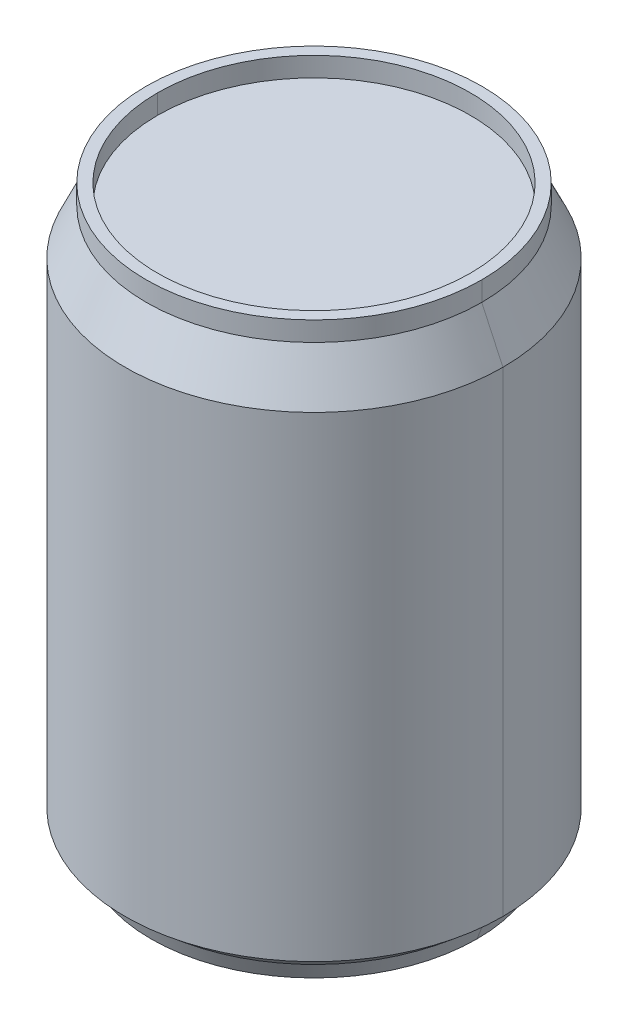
ISO-10303-21;
HEADER;
FILE_DESCRIPTION(('STEP AP214'),'2;1');
FILE_NAME('part.step','',(''),(''),'','','');
FILE_SCHEMA(('AUTOMOTIVE_DESIGN { 1 0 10303 214 1 1 1 1 }'));
ENDSEC;
DATA;
#1=APPLICATION_CONTEXT('core data for automotive mechanical design processes');
#2=APPLICATION_PROTOCOL_DEFINITION('international standard','automotive_design',2000,#1);
#3=PRODUCT_CONTEXT('',#1,'mechanical');
#4=PRODUCT('Part','Part','',(#3));
#5=PRODUCT_RELATED_PRODUCT_CATEGORY('part','',(#4));
#6=PRODUCT_DEFINITION_FORMATION('','',#4);
#7=PRODUCT_DEFINITION_CONTEXT('part definition',#1,'design');
#8=PRODUCT_DEFINITION('design','',#6,#7);
#9=PRODUCT_DEFINITION_SHAPE('','',#8);
#10=(LENGTH_UNIT() NAMED_UNIT(*) SI_UNIT(.MILLI.,.METRE.));
#11=(NAMED_UNIT(*) PLANE_ANGLE_UNIT() SI_UNIT($,.RADIAN.));
#12=(NAMED_UNIT(*) SI_UNIT($,.STERADIAN.) SOLID_ANGLE_UNIT());
#13=UNCERTAINTY_MEASURE_WITH_UNIT(LENGTH_MEASURE(1.E-05),#10,'distance_accuracy_value','');
#14=(GEOMETRIC_REPRESENTATION_CONTEXT(3) GLOBAL_UNCERTAINTY_ASSIGNED_CONTEXT((#13)) GLOBAL_UNIT_ASSIGNED_CONTEXT((#10,
#11,#12)) REPRESENTATION_CONTEXT('',''));
#15=CARTESIAN_POINT('',(0.,0.,0.));
#16=DIRECTION('',(0.,0.,1.));
#17=DIRECTION('',(1.,0.,0.));
#18=AXIS2_PLACEMENT_3D('',#15,#16,#17);
#19=CARTESIAN_POINT('',(0.,-26.0166666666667,0.));
#20=DIRECTION('',(0.,0.,1.));
#21=DIRECTION('',(-1.,0.,0.));
#22=AXIS2_PLACEMENT_3D('',#19,#20,#21);
#23=SPHERICAL_SURFACE('',#22,36.0166666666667);
#24=CARTESIAN_POINT('',(0.,-26.0166666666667,0.));
#25=DIRECTION('',(0.,0.,1.));
#26=DIRECTION('',(1.,0.,0.));
#27=AXIS2_PLACEMENT_3D('',#24,#25,#26);
#28=CIRCLE('',#27,36.0166666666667);
#29=CARTESIAN_POINT('',(22.,2.5,0.));
#30=VERTEX_POINT('',#29);
#31=CARTESIAN_POINT('',(0.,10.,0.));
#32=VERTEX_POINT('',#31);
#33=EDGE_CURVE('E253',#30,#32,#28,.T.);
#34=ORIENTED_EDGE('',*,*,#33,.F.);
#35=CARTESIAN_POINT('',(0.,2.5,0.));
#36=DIRECTION('',(0.,1.,0.));
#37=DIRECTION('',(-1.,0.,0.));
#38=AXIS2_PLACEMENT_3D('',#35,#36,#37);
#39=CIRCLE('',#38,22.);
#40=CARTESIAN_POINT('',(-22.,2.5,0.));
#41=VERTEX_POINT('',#40);
#42=EDGE_CURVE('E11',#41,#30,#39,.T.);
#43=ORIENTED_EDGE('',*,*,#42,.F.);
#44=CARTESIAN_POINT('',(0.,-26.0166666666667,0.));
#45=DIRECTION('',(0.,0.,-1.));
#46=DIRECTION('',(-1.,0.,0.));
#47=AXIS2_PLACEMENT_3D('',#44,#45,#46);
#48=CIRCLE('',#47,36.0166666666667);
#49=EDGE_CURVE('E251',#41,#32,#48,.T.);
#50=ORIENTED_EDGE('',*,*,#49,.T.);
#51=EDGE_LOOP('',(#34,#43,#50));
#52=FACE_BOUND('',#51,.T.);
#53=ADVANCED_FACE('F16',(#52),#23,.F.);
#54=CARTESIAN_POINT('',(0.,85.,0.));
#55=DIRECTION('',(0.,1.,0.));
#56=DIRECTION('',(-1.,0.,0.));
#57=AXIS2_PLACEMENT_3D('',#54,#55,#56);
#58=CYLINDRICAL_SURFACE('',#57,22.);
#59=DIRECTION('',(0.,1.,0.));
#60=VECTOR('',#59,1.);
#61=CARTESIAN_POINT('',(22.,85.,0.));
#62=LINE('',#61,#60);
#63=CARTESIAN_POINT('',(22.,0.,0.));
#64=VERTEX_POINT('',#63);
#65=EDGE_CURVE('E265',#64,#30,#62,.T.);
#66=ORIENTED_EDGE('',*,*,#65,.F.);
#67=CARTESIAN_POINT('',(0.,0.,0.));
#68=DIRECTION('',(0.,1.,0.));
#69=DIRECTION('',(-1.,0.,0.));
#70=AXIS2_PLACEMENT_3D('',#67,#68,#69);
#71=CIRCLE('',#70,22.);
#72=CARTESIAN_POINT('',(-22.,0.,0.));
#73=VERTEX_POINT('',#72);
#74=EDGE_CURVE('E27',#73,#64,#71,.T.);
#75=ORIENTED_EDGE('',*,*,#74,.F.);
#76=DIRECTION('',(0.,1.,0.));
#77=VECTOR('',#76,1.);
#78=CARTESIAN_POINT('',(-22.,85.,0.));
#79=LINE('',#78,#77);
#80=EDGE_CURVE('E193',#73,#41,#79,.T.);
#81=ORIENTED_EDGE('',*,*,#80,.T.);
#82=ORIENTED_EDGE('',*,*,#42,.T.);
#83=EDGE_LOOP('',(#66,#75,#81,#82));
#84=FACE_BOUND('',#83,.T.);
#85=ADVANCED_FACE('F259',(#84),#58,.F.);
#86=CARTESIAN_POINT('',(-25.,0.,0.));
#87=DIRECTION('',(0.,-1.,0.));
#88=DIRECTION('',(-1.,0.,0.));
#89=AXIS2_PLACEMENT_3D('',#86,#87,#88);
#90=PLANE('',#89);
#91=ORIENTED_EDGE('',*,*,#74,.T.);
#92=CARTESIAN_POINT('',(0.,0.,0.));
#93=DIRECTION('',(0.,1.,0.));
#94=DIRECTION('',(-1.,0.,0.));
#95=AXIS2_PLACEMENT_3D('',#92,#93,#94);
#96=CIRCLE('',#95,22.);
#97=EDGE_CURVE('E271',#64,#73,#96,.T.);
#98=ORIENTED_EDGE('',*,*,#97,.T.);
#99=EDGE_LOOP('',(#91,#98));
#100=FACE_BOUND('',#99,.T.);
#101=CARTESIAN_POINT('',(0.,0.,0.));
#102=DIRECTION('',(0.,1.,0.));
#103=DIRECTION('',(-1.,0.,0.));
#104=AXIS2_PLACEMENT_3D('',#101,#102,#103);
#105=CIRCLE('',#104,25.);
#106=CARTESIAN_POINT('',(-25.,0.,0.));
#107=VERTEX_POINT('',#106);
#108=CARTESIAN_POINT('',(25.,0.,0.));
#109=VERTEX_POINT('',#108);
#110=EDGE_CURVE('E188',#107,#109,#105,.T.);
#111=ORIENTED_EDGE('',*,*,#110,.F.);
#112=CARTESIAN_POINT('',(0.,0.,0.));
#113=DIRECTION('',(0.,1.,0.));
#114=DIRECTION('',(-1.,0.,0.));
#115=AXIS2_PLACEMENT_3D('',#112,#113,#114);
#116=CIRCLE('',#115,25.);
#117=EDGE_CURVE('E212',#109,#107,#116,.T.);
#118=ORIENTED_EDGE('',*,*,#117,.F.);
#119=EDGE_LOOP('',(#111,#118));
#120=FACE_BOUND('',#119,.T.);
#121=ADVANCED_FACE('F321',(#100,#120),#90,.T.);
#122=CARTESIAN_POINT('',(0.,2.5,0.));
#123=DIRECTION('',(0.,1.,0.));
#124=DIRECTION('',(-1.,0.,0.));
#125=AXIS2_PLACEMENT_3D('',#122,#123,#124);
#126=CONICAL_SURFACE('',#125,26.,0.380506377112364);
#127=DIRECTION('',(0.371390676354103,0.92847669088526,0.));
#128=VECTOR('',#127,1.);
#129=CARTESIAN_POINT('',(26.,2.5,0.));
#130=LINE('',#129,#128);
#131=CARTESIAN_POINT('',(26.,2.5,0.));
#132=VERTEX_POINT('',#131);
#133=EDGE_CURVE('E192',#109,#132,#130,.T.);
#134=ORIENTED_EDGE('',*,*,#133,.F.);
#135=ORIENTED_EDGE('',*,*,#117,.T.);
#136=DIRECTION('',(-0.371390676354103,0.92847669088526,0.));
#137=VECTOR('',#136,1.);
#138=CARTESIAN_POINT('',(-26.,2.5,0.));
#139=LINE('',#138,#137);
#140=CARTESIAN_POINT('',(-26.,2.5,0.));
#141=VERTEX_POINT('',#140);
#142=EDGE_CURVE('E161',#107,#141,#139,.T.);
#143=ORIENTED_EDGE('',*,*,#142,.T.);
#144=CARTESIAN_POINT('',(0.,2.5,0.));
#145=DIRECTION('',(0.,1.,0.));
#146=DIRECTION('',(-1.,0.,0.));
#147=AXIS2_PLACEMENT_3D('',#144,#145,#146);
#148=CIRCLE('',#147,26.);
#149=EDGE_CURVE('E20',#132,#141,#148,.T.);
#150=ORIENTED_EDGE('',*,*,#149,.F.);
#151=EDGE_LOOP('',(#134,#135,#143,#150));
#152=FACE_BOUND('',#151,.T.);
#153=ADVANCED_FACE('F316',(#152),#126,.T.);
#154=CARTESIAN_POINT('',(0.,5.,0.));
#155=DIRECTION('',(0.,1.,0.));
#156=DIRECTION('',(-1.,0.,0.));
#157=AXIS2_PLACEMENT_3D('',#154,#155,#156);
#158=CONICAL_SURFACE('',#157,29.,0.876058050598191);
#159=DIRECTION('',(0.768221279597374,0.640184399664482,0.));
#160=VECTOR('',#159,1.);
#161=CARTESIAN_POINT('',(29.,5.,0.));
#162=LINE('',#161,#160);
#163=CARTESIAN_POINT('',(29.,5.,0.));
#164=VERTEX_POINT('',#163);
#165=EDGE_CURVE('E165',#132,#164,#162,.T.);
#166=ORIENTED_EDGE('',*,*,#165,.F.);
#167=ORIENTED_EDGE('',*,*,#149,.T.);
#168=DIRECTION('',(-0.768221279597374,0.640184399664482,0.));
#169=VECTOR('',#168,1.);
#170=CARTESIAN_POINT('',(-29.,5.,0.));
#171=LINE('',#170,#169);
#172=CARTESIAN_POINT('',(-29.,5.,0.));
#173=VERTEX_POINT('',#172);
#174=EDGE_CURVE('E148',#141,#173,#171,.T.);
#175=ORIENTED_EDGE('',*,*,#174,.T.);
#176=CARTESIAN_POINT('',(0.,5.,0.));
#177=DIRECTION('',(0.,1.,0.));
#178=DIRECTION('',(-1.,0.,0.));
#179=AXIS2_PLACEMENT_3D('',#176,#177,#178);
#180=CIRCLE('',#179,29.);
#181=EDGE_CURVE('E119',#164,#173,#180,.T.);
#182=ORIENTED_EDGE('',*,*,#181,.F.);
#183=EDGE_LOOP('',(#166,#167,#175,#182));
#184=FACE_BOUND('',#183,.T.);
#185=ADVANCED_FACE('F308',(#184),#158,.T.);
#186=CARTESIAN_POINT('',(0.,85.,0.));
#187=DIRECTION('',(0.,1.,0.));
#188=DIRECTION('',(-1.,0.,0.));
#189=AXIS2_PLACEMENT_3D('',#186,#187,#188);
#190=CYLINDRICAL_SURFACE('',#189,29.);
#191=DIRECTION('',(0.,1.,0.));
#192=VECTOR('',#191,1.);
#193=CARTESIAN_POINT('',(29.,85.,0.));
#194=LINE('',#193,#192);
#195=CARTESIAN_POINT('',(29.,78.,0.));
#196=VERTEX_POINT('',#195);
#197=EDGE_CURVE('E141',#164,#196,#194,.T.);
#198=ORIENTED_EDGE('',*,*,#197,.F.);
#199=ORIENTED_EDGE('',*,*,#181,.T.);
#200=DIRECTION('',(0.,1.,0.));
#201=VECTOR('',#200,1.);
#202=CARTESIAN_POINT('',(-29.,85.,0.));
#203=LINE('',#202,#201);
#204=CARTESIAN_POINT('',(-29.,78.,0.));
#205=VERTEX_POINT('',#204);
#206=EDGE_CURVE('E133',#173,#205,#203,.T.);
#207=ORIENTED_EDGE('',*,*,#206,.T.);
#208=CARTESIAN_POINT('',(0.,78.,0.));
#209=DIRECTION('',(0.,1.,0.));
#210=DIRECTION('',(-1.,0.,0.));
#211=AXIS2_PLACEMENT_3D('',#208,#209,#210);
#212=CIRCLE('',#211,29.);
#213=EDGE_CURVE('E107',#196,#205,#212,.T.);
#214=ORIENTED_EDGE('',*,*,#213,.F.);
#215=EDGE_LOOP('',(#198,#199,#207,#214));
#216=FACE_BOUND('',#215,.T.);
#217=ADVANCED_FACE('F134',(#216),#190,.T.);
#218=CARTESIAN_POINT('',(0.,85.,0.));
#219=DIRECTION('',(0.,-1.,0.));
#220=DIRECTION('',(1.,0.,0.));
#221=AXIS2_PLACEMENT_3D('',#218,#219,#220);
#222=CONICAL_SURFACE('',#221,25.75,0.434670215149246);
#223=DIRECTION('',(-0.42111130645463,-0.907008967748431,0.));
#224=VECTOR('',#223,1.);
#225=CARTESIAN_POINT('',(-25.75,85.,0.));
#226=LINE('',#225,#224);
#227=CARTESIAN_POINT('',(-25.75,85.,0.));
#228=VERTEX_POINT('',#227);
#229=EDGE_CURVE('E110',#228,#205,#226,.T.);
#230=ORIENTED_EDGE('',*,*,#229,.F.);
#231=CARTESIAN_POINT('',(0.,85.,0.));
#232=DIRECTION('',(0.,1.,0.));
#233=DIRECTION('',(-1.,0.,0.));
#234=AXIS2_PLACEMENT_3D('',#231,#232,#233);
#235=CIRCLE('',#234,25.75);
#236=CARTESIAN_POINT('',(25.75,85.,0.));
#237=VERTEX_POINT('',#236);
#238=EDGE_CURVE('E120',#237,#228,#235,.T.);
#239=ORIENTED_EDGE('',*,*,#238,.F.);
#240=DIRECTION('',(0.42111130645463,-0.907008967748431,0.));
#241=VECTOR('',#240,1.);
#242=CARTESIAN_POINT('',(25.75,85.,0.));
#243=LINE('',#242,#241);
#244=EDGE_CURVE('E113',#237,#196,#243,.T.);
#245=ORIENTED_EDGE('',*,*,#244,.T.);
#246=ORIENTED_EDGE('',*,*,#213,.T.);
#247=EDGE_LOOP('',(#230,#239,#245,#246));
#248=FACE_BOUND('',#247,.T.);
#249=ADVANCED_FACE('F109',(#248),#222,.T.);
#250=CARTESIAN_POINT('',(0.,85.,0.));
#251=DIRECTION('',(0.,1.,0.));
#252=DIRECTION('',(-1.,0.,0.));
#253=AXIS2_PLACEMENT_3D('',#250,#251,#252);
#254=CYLINDRICAL_SURFACE('',#253,25.75);
#255=DIRECTION('',(0.,1.,0.));
#256=VECTOR('',#255,1.);
#257=CARTESIAN_POINT('',(25.75,85.,0.));
#258=LINE('',#257,#256);
#259=CARTESIAN_POINT('',(25.75,88.,0.));
#260=VERTEX_POINT('',#259);
#261=EDGE_CURVE('E182',#237,#260,#258,.T.);
#262=ORIENTED_EDGE('',*,*,#261,.F.);
#263=ORIENTED_EDGE('',*,*,#238,.T.);
#264=DIRECTION('',(0.,1.,0.));
#265=VECTOR('',#264,1.);
#266=CARTESIAN_POINT('',(-25.75,85.,0.));
#267=LINE('',#266,#265);
#268=CARTESIAN_POINT('',(-25.75,88.,0.));
#269=VERTEX_POINT('',#268);
#270=EDGE_CURVE('E171',#228,#269,#267,.T.);
#271=ORIENTED_EDGE('',*,*,#270,.T.);
#272=CARTESIAN_POINT('',(0.,88.,0.));
#273=DIRECTION('',(0.,1.,0.));
#274=DIRECTION('',(-1.,0.,0.));
#275=AXIS2_PLACEMENT_3D('',#272,#273,#274);
#276=CIRCLE('',#275,25.75);
#277=EDGE_CURVE('E178',#260,#269,#276,.T.);
#278=ORIENTED_EDGE('',*,*,#277,.F.);
#279=EDGE_LOOP('',(#262,#263,#271,#278));
#280=FACE_BOUND('',#279,.T.);
#281=ADVANCED_FACE('F228',(#280),#254,.T.);
#282=CARTESIAN_POINT('',(-24.,88.,0.));
#283=DIRECTION('',(0.,1.,0.));
#284=DIRECTION('',(1.,0.,0.));
#285=AXIS2_PLACEMENT_3D('',#282,#283,#284);
#286=PLANE('',#285);
#287=CARTESIAN_POINT('',(0.,88.,0.));
#288=DIRECTION('',(0.,1.,0.));
#289=DIRECTION('',(-1.,0.,0.));
#290=AXIS2_PLACEMENT_3D('',#287,#288,#289);
#291=CIRCLE('',#290,24.);
#292=CARTESIAN_POINT('',(-24.,88.,0.));
#293=VERTEX_POINT('',#292);
#294=CARTESIAN_POINT('',(24.,88.,0.));
#295=VERTEX_POINT('',#294);
#296=EDGE_CURVE('E41',#293,#295,#291,.T.);
#297=ORIENTED_EDGE('',*,*,#296,.F.);
#298=CARTESIAN_POINT('',(0.,88.,0.));
#299=DIRECTION('',(0.,1.,0.));
#300=DIRECTION('',(-1.,0.,0.));
#301=AXIS2_PLACEMENT_3D('',#298,#299,#300);
#302=CIRCLE('',#301,24.);
#303=EDGE_CURVE('E155',#295,#293,#302,.T.);
#304=ORIENTED_EDGE('',*,*,#303,.F.);
#305=EDGE_LOOP('',(#297,#304));
#306=FACE_BOUND('',#305,.T.);
#307=CARTESIAN_POINT('',(0.,88.,0.));
#308=DIRECTION('',(0.,1.,0.));
#309=DIRECTION('',(-1.,0.,0.));
#310=AXIS2_PLACEMENT_3D('',#307,#308,#309);
#311=CIRCLE('',#310,25.75);
#312=EDGE_CURVE('E175',#269,#260,#311,.T.);
#313=ORIENTED_EDGE('',*,*,#312,.T.);
#314=ORIENTED_EDGE('',*,*,#277,.T.);
#315=EDGE_LOOP('',(#313,#314));
#316=FACE_BOUND('',#315,.T.);
#317=ADVANCED_FACE('F338',(#306,#316),#286,.T.);
#318=CARTESIAN_POINT('',(0.,85.,0.));
#319=DIRECTION('',(0.,1.,0.));
#320=DIRECTION('',(-1.,0.,0.));
#321=AXIS2_PLACEMENT_3D('',#318,#319,#320);
#322=CYLINDRICAL_SURFACE('',#321,24.);
#323=DIRECTION('',(0.,1.,0.));
#324=VECTOR('',#323,1.);
#325=CARTESIAN_POINT('',(24.,85.,0.));
#326=LINE('',#325,#324);
#327=CARTESIAN_POINT('',(24.,85.,0.));
#328=VERTEX_POINT('',#327);
#329=EDGE_CURVE('E160',#328,#295,#326,.T.);
#330=ORIENTED_EDGE('',*,*,#329,.F.);
#331=CARTESIAN_POINT('',(0.,85.,0.));
#332=DIRECTION('',(0.,1.,0.));
#333=DIRECTION('',(-1.,0.,0.));
#334=AXIS2_PLACEMENT_3D('',#331,#332,#333);
#335=CIRCLE('',#334,24.);
#336=CARTESIAN_POINT('',(-24.,85.,0.));
#337=VERTEX_POINT('',#336);
#338=EDGE_CURVE('E179',#337,#328,#335,.T.);
#339=ORIENTED_EDGE('',*,*,#338,.F.);
#340=DIRECTION('',(0.,1.,0.));
#341=VECTOR('',#340,1.);
#342=CARTESIAN_POINT('',(-24.,85.,0.));
#343=LINE('',#342,#341);
#344=EDGE_CURVE('E159',#337,#293,#343,.T.);
#345=ORIENTED_EDGE('',*,*,#344,.T.);
#346=ORIENTED_EDGE('',*,*,#296,.T.);
#347=EDGE_LOOP('',(#330,#339,#345,#346));
#348=FACE_BOUND('',#347,.T.);
#349=ADVANCED_FACE('F18',(#348),#322,.F.);
#350=CARTESIAN_POINT('',(0.,85.,0.));
#351=DIRECTION('',(0.,1.,0.));
#352=DIRECTION('',(1.,0.,0.));
#353=AXIS2_PLACEMENT_3D('',#350,#351,#352);
#354=PLANE('',#353);
#355=ORIENTED_EDGE('',*,*,#338,.T.);
#356=CARTESIAN_POINT('',(0.,85.,0.));
#357=DIRECTION('',(0.,1.,0.));
#358=DIRECTION('',(-1.,0.,0.));
#359=AXIS2_PLACEMENT_3D('',#356,#357,#358);
#360=CIRCLE('',#359,24.);
#361=EDGE_CURVE('E170',#328,#337,#360,.T.);
#362=ORIENTED_EDGE('',*,*,#361,.T.);
#363=EDGE_LOOP('',(#355,#362));
#364=FACE_BOUND('',#363,.T.);
#365=ADVANCED_FACE('F347',(#364),#354,.T.);
#366=CARTESIAN_POINT('',(0.,85.,0.));
#367=DIRECTION('',(0.,1.,0.));
#368=DIRECTION('',(-1.,0.,0.));
#369=AXIS2_PLACEMENT_3D('',#366,#367,#368);
#370=CYLINDRICAL_SURFACE('',#369,24.);
#371=ORIENTED_EDGE('',*,*,#361,.F.);
#372=ORIENTED_EDGE('',*,*,#329,.T.);
#373=ORIENTED_EDGE('',*,*,#303,.T.);
#374=ORIENTED_EDGE('',*,*,#344,.F.);
#375=EDGE_LOOP('',(#371,#372,#373,#374));
#376=FACE_BOUND('',#375,.T.);
#377=ADVANCED_FACE('F351',(#376),#370,.F.);
#378=CARTESIAN_POINT('',(0.,85.,0.));
#379=DIRECTION('',(0.,1.,0.));
#380=DIRECTION('',(-1.,0.,0.));
#381=AXIS2_PLACEMENT_3D('',#378,#379,#380);
#382=CYLINDRICAL_SURFACE('',#381,25.75);
#383=CARTESIAN_POINT('',(0.,85.,0.));
#384=DIRECTION('',(0.,1.,0.));
#385=DIRECTION('',(-1.,0.,0.));
#386=AXIS2_PLACEMENT_3D('',#383,#384,#385);
#387=CIRCLE('',#386,25.75);
#388=EDGE_CURVE('E128',#228,#237,#387,.T.);
#389=ORIENTED_EDGE('',*,*,#388,.T.);
#390=ORIENTED_EDGE('',*,*,#261,.T.);
#391=ORIENTED_EDGE('',*,*,#312,.F.);
#392=ORIENTED_EDGE('',*,*,#270,.F.);
#393=EDGE_LOOP('',(#389,#390,#391,#392));
#394=FACE_BOUND('',#393,.T.);
#395=ADVANCED_FACE('F224',(#394),#382,.T.);
#396=CARTESIAN_POINT('',(0.,85.,0.));
#397=DIRECTION('',(0.,-1.,0.));
#398=DIRECTION('',(1.,0.,0.));
#399=AXIS2_PLACEMENT_3D('',#396,#397,#398);
#400=CONICAL_SURFACE('',#399,25.75,0.434670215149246);
#401=ORIENTED_EDGE('',*,*,#388,.F.);
#402=ORIENTED_EDGE('',*,*,#229,.T.);
#403=CARTESIAN_POINT('',(0.,78.,0.));
#404=DIRECTION('',(0.,1.,0.));
#405=DIRECTION('',(-1.,0.,0.));
#406=AXIS2_PLACEMENT_3D('',#403,#404,#405);
#407=CIRCLE('',#406,29.);
#408=EDGE_CURVE('E125',#205,#196,#407,.T.);
#409=ORIENTED_EDGE('',*,*,#408,.T.);
#410=ORIENTED_EDGE('',*,*,#244,.F.);
#411=EDGE_LOOP('',(#401,#402,#409,#410));
#412=FACE_BOUND('',#411,.T.);
#413=ADVANCED_FACE('F123',(#412),#400,.T.);
#414=CARTESIAN_POINT('',(0.,85.,0.));
#415=DIRECTION('',(0.,1.,0.));
#416=DIRECTION('',(-1.,0.,0.));
#417=AXIS2_PLACEMENT_3D('',#414,#415,#416);
#418=CYLINDRICAL_SURFACE('',#417,29.);
#419=CARTESIAN_POINT('',(0.,5.,0.));
#420=DIRECTION('',(0.,1.,0.));
#421=DIRECTION('',(-1.,0.,0.));
#422=AXIS2_PLACEMENT_3D('',#419,#420,#421);
#423=CIRCLE('',#422,29.);
#424=EDGE_CURVE('E154',#173,#164,#423,.T.);
#425=ORIENTED_EDGE('',*,*,#424,.T.);
#426=ORIENTED_EDGE('',*,*,#197,.T.);
#427=ORIENTED_EDGE('',*,*,#408,.F.);
#428=ORIENTED_EDGE('',*,*,#206,.F.);
#429=EDGE_LOOP('',(#425,#426,#427,#428));
#430=FACE_BOUND('',#429,.T.);
#431=ADVANCED_FACE('F140',(#430),#418,.T.);
#432=CARTESIAN_POINT('',(0.,5.,0.));
#433=DIRECTION('',(0.,1.,0.));
#434=DIRECTION('',(-1.,0.,0.));
#435=AXIS2_PLACEMENT_3D('',#432,#433,#434);
#436=CONICAL_SURFACE('',#435,29.,0.876058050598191);
#437=CARTESIAN_POINT('',(0.,2.5,0.));
#438=DIRECTION('',(0.,1.,0.));
#439=DIRECTION('',(-1.,0.,0.));
#440=AXIS2_PLACEMENT_3D('',#437,#438,#439);
#441=CIRCLE('',#440,26.);
#442=EDGE_CURVE('E166',#141,#132,#441,.T.);
#443=ORIENTED_EDGE('',*,*,#442,.T.);
#444=ORIENTED_EDGE('',*,*,#165,.T.);
#445=ORIENTED_EDGE('',*,*,#424,.F.);
#446=ORIENTED_EDGE('',*,*,#174,.F.);
#447=EDGE_LOOP('',(#443,#444,#445,#446));
#448=FACE_BOUND('',#447,.T.);
#449=ADVANCED_FACE('F313',(#448),#436,.T.);
#450=CARTESIAN_POINT('',(0.,2.5,0.));
#451=DIRECTION('',(0.,1.,0.));
#452=DIRECTION('',(-1.,0.,0.));
#453=AXIS2_PLACEMENT_3D('',#450,#451,#452);
#454=CONICAL_SURFACE('',#453,26.,0.380506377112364);
#455=ORIENTED_EDGE('',*,*,#110,.T.);
#456=ORIENTED_EDGE('',*,*,#133,.T.);
#457=ORIENTED_EDGE('',*,*,#442,.F.);
#458=ORIENTED_EDGE('',*,*,#142,.F.);
#459=EDGE_LOOP('',(#455,#456,#457,#458));
#460=FACE_BOUND('',#459,.T.);
#461=ADVANCED_FACE('F319',(#460),#454,.T.);
#462=CARTESIAN_POINT('',(0.,85.,0.));
#463=DIRECTION('',(0.,1.,0.));
#464=DIRECTION('',(-1.,0.,0.));
#465=AXIS2_PLACEMENT_3D('',#462,#463,#464);
#466=CYLINDRICAL_SURFACE('',#465,22.);
#467=ORIENTED_EDGE('',*,*,#97,.F.);
#468=ORIENTED_EDGE('',*,*,#65,.T.);
#469=CARTESIAN_POINT('',(0.,2.5,0.));
#470=DIRECTION('',(0.,1.,0.));
#471=DIRECTION('',(-1.,0.,0.));
#472=AXIS2_PLACEMENT_3D('',#469,#470,#471);
#473=CIRCLE('',#472,22.);
#474=EDGE_CURVE('E269',#30,#41,#473,.T.);
#475=ORIENTED_EDGE('',*,*,#474,.T.);
#476=ORIENTED_EDGE('',*,*,#80,.F.);
#477=EDGE_LOOP('',(#467,#468,#475,#476));
#478=FACE_BOUND('',#477,.T.);
#479=ADVANCED_FACE('F273',(#478),#466,.F.);
#480=CARTESIAN_POINT('',(0.,-26.0166666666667,0.));
#481=DIRECTION('',(0.,0.,1.));
#482=DIRECTION('',(-1.,0.,0.));
#483=AXIS2_PLACEMENT_3D('',#480,#481,#482);
#484=SPHERICAL_SURFACE('',#483,36.0166666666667);
#485=ORIENTED_EDGE('',*,*,#474,.F.);
#486=ORIENTED_EDGE('',*,*,#33,.T.);
#487=ORIENTED_EDGE('',*,*,#49,.F.);
#488=EDGE_LOOP('',(#485,#486,#487));
#489=FACE_BOUND('',#488,.T.);
#490=ADVANCED_FACE('F268',(#489),#484,.F.);
#491=CLOSED_SHELL('',(#53,#85,#121,#153,#185,#217,#249,#281,#317,#349,#365,#377,#395,#413,#431,
#449,#461,#479,#490));
#492=MANIFOLD_SOLID_BREP('B1',#491);
#493=ADVANCED_BREP_SHAPE_REPRESENTATION('',(#18,#492),#14);
#494=SHAPE_DEFINITION_REPRESENTATION(#9,#493);
ENDSEC;
END-ISO-10303-21;
